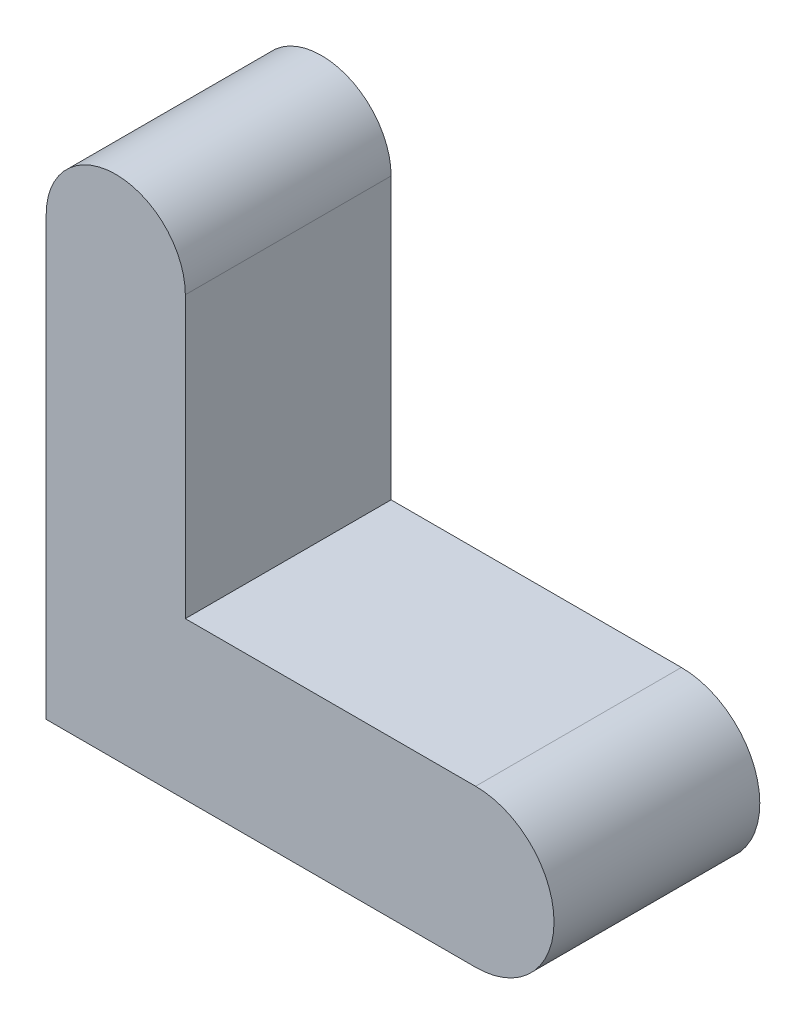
ISO-10303-21;
HEADER;
FILE_DESCRIPTION(('STEP AP214'),'2;1');
FILE_NAME('part.step','',(''),(''),'','','');
FILE_SCHEMA(('AUTOMOTIVE_DESIGN { 1 0 10303 214 1 1 1 1 }'));
ENDSEC;
DATA;
#1=APPLICATION_CONTEXT('core data for automotive mechanical design processes');
#2=APPLICATION_PROTOCOL_DEFINITION('international standard','automotive_design',2000,#1);
#3=PRODUCT_CONTEXT('',#1,'mechanical');
#4=PRODUCT('Part','Part','',(#3));
#5=PRODUCT_RELATED_PRODUCT_CATEGORY('part','',(#4));
#6=PRODUCT_DEFINITION_FORMATION('','',#4);
#7=PRODUCT_DEFINITION_CONTEXT('part definition',#1,'design');
#8=PRODUCT_DEFINITION('design','',#6,#7);
#9=PRODUCT_DEFINITION_SHAPE('','',#8);
#10=(LENGTH_UNIT() NAMED_UNIT(*) SI_UNIT(.MILLI.,.METRE.));
#11=(NAMED_UNIT(*) PLANE_ANGLE_UNIT() SI_UNIT($,.RADIAN.));
#12=(NAMED_UNIT(*) SI_UNIT($,.STERADIAN.) SOLID_ANGLE_UNIT());
#13=UNCERTAINTY_MEASURE_WITH_UNIT(LENGTH_MEASURE(1.E-05),#10,'distance_accuracy_value','');
#14=(GEOMETRIC_REPRESENTATION_CONTEXT(3) GLOBAL_UNCERTAINTY_ASSIGNED_CONTEXT((#13)) GLOBAL_UNIT_ASSIGNED_CONTEXT((#10,
#11,#12)) REPRESENTATION_CONTEXT('',''));
#15=CARTESIAN_POINT('',(0.,0.,0.));
#16=DIRECTION('',(0.,0.,1.));
#17=DIRECTION('',(1.,0.,0.));
#18=AXIS2_PLACEMENT_3D('',#15,#16,#17);
#19=CARTESIAN_POINT('',(45.1262891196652,0.,81.));
#20=DIRECTION('',(0.,0.,-1.));
#21=DIRECTION('',(-1.,0.,0.));
#22=AXIS2_PLACEMENT_3D('',#19,#20,#21);
#23=CYLINDRICAL_SURFACE('',#22,19.4348844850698);
#24=CARTESIAN_POINT('',(45.1262891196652,0.,30.));
#25=DIRECTION('',(0.,0.,1.));
#26=DIRECTION('',(1.,0.,0.));
#27=AXIS2_PLACEMENT_3D('',#24,#25,#26);
#28=CIRCLE('',#27,19.4348844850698);
#29=CARTESIAN_POINT('',(45.1262891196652,-19.4348844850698,30.));
#30=VERTEX_POINT('',#29);
#31=CARTESIAN_POINT('',(45.1262891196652,19.4348844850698,30.));
#32=VERTEX_POINT('',#31);
#33=EDGE_CURVE('E88',#30,#32,#28,.T.);
#34=ORIENTED_EDGE('',*,*,#33,.T.);
#35=DIRECTION('',(0.,0.,-1.));
#36=VECTOR('',#35,1.);
#37=CARTESIAN_POINT('',(45.1262891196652,19.4348844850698,81.));
#38=LINE('',#37,#36);
#39=CARTESIAN_POINT('',(45.1262891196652,19.4348844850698,81.));
#40=VERTEX_POINT('',#39);
#41=EDGE_CURVE('E11',#40,#32,#38,.T.);
#42=ORIENTED_EDGE('',*,*,#41,.F.);
#43=CARTESIAN_POINT('',(45.1262891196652,0.,81.));
#44=DIRECTION('',(0.,0.,1.));
#45=DIRECTION('',(1.,0.,0.));
#46=AXIS2_PLACEMENT_3D('',#43,#44,#45);
#47=CIRCLE('',#46,19.4348844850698);
#48=CARTESIAN_POINT('',(45.1262891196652,-19.4348844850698,81.));
#49=VERTEX_POINT('',#48);
#50=EDGE_CURVE('E111',#49,#40,#47,.T.);
#51=ORIENTED_EDGE('',*,*,#50,.F.);
#52=DIRECTION('',(0.,0.,-1.));
#53=VECTOR('',#52,1.);
#54=CARTESIAN_POINT('',(45.1262891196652,-19.4348844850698,81.));
#55=LINE('',#54,#53);
#56=EDGE_CURVE('E101',#49,#30,#55,.T.);
#57=ORIENTED_EDGE('',*,*,#56,.T.);
#58=EDGE_LOOP('',(#34,#42,#51,#57));
#59=FACE_BOUND('',#58,.T.);
#60=ADVANCED_FACE('F32',(#59),#23,.T.);
#61=CARTESIAN_POINT('',(45.1262891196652,19.4348844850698,81.));
#62=DIRECTION('',(0.,-1.,0.));
#63=DIRECTION('',(1.,0.,0.));
#64=AXIS2_PLACEMENT_3D('',#61,#62,#63);
#65=PLANE('',#64);
#66=DIRECTION('',(-1.,0.,0.));
#67=VECTOR('',#66,1.);
#68=CARTESIAN_POINT('',(45.1262891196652,19.4348844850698,30.));
#69=LINE('',#68,#67);
#70=CARTESIAN_POINT('',(-26.8203416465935,19.4348844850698,30.));
#71=VERTEX_POINT('',#70);
#72=EDGE_CURVE('E84',#32,#71,#69,.T.);
#73=ORIENTED_EDGE('',*,*,#72,.T.);
#74=DIRECTION('',(0.,0.,-1.));
#75=VECTOR('',#74,1.);
#76=CARTESIAN_POINT('',(-26.8203416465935,19.4348844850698,81.));
#77=LINE('',#76,#75);
#78=CARTESIAN_POINT('',(-26.8203416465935,19.4348844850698,81.));
#79=VERTEX_POINT('',#78);
#80=EDGE_CURVE('E39',#79,#71,#77,.T.);
#81=ORIENTED_EDGE('',*,*,#80,.F.);
#82=DIRECTION('',(-1.,0.,0.));
#83=VECTOR('',#82,1.);
#84=CARTESIAN_POINT('',(45.1262891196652,19.4348844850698,81.));
#85=LINE('',#84,#83);
#86=EDGE_CURVE('E97',#40,#79,#85,.T.);
#87=ORIENTED_EDGE('',*,*,#86,.F.);
#88=ORIENTED_EDGE('',*,*,#41,.T.);
#89=EDGE_LOOP('',(#73,#81,#87,#88));
#90=FACE_BOUND('',#89,.T.);
#91=ADVANCED_FACE('F96',(#90),#65,.F.);
#92=CARTESIAN_POINT('',(-26.8203416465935,19.4348844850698,81.));
#93=DIRECTION('',(-1.,0.,0.));
#94=DIRECTION('',(0.,0.,1.));
#95=AXIS2_PLACEMENT_3D('',#92,#93,#94);
#96=PLANE('',#95);
#97=DIRECTION('',(0.,1.,0.));
#98=VECTOR('',#97,1.);
#99=CARTESIAN_POINT('',(-26.8203416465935,19.4348844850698,30.));
#100=LINE('',#99,#98);
#101=CARTESIAN_POINT('',(-26.8203416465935,88.9543759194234,30.));
#102=VERTEX_POINT('',#101);
#103=EDGE_CURVE('E90',#71,#102,#100,.T.);
#104=ORIENTED_EDGE('',*,*,#103,.T.);
#105=DIRECTION('',(0.,0.,-1.));
#106=VECTOR('',#105,1.);
#107=CARTESIAN_POINT('',(-26.8203416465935,88.9543759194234,81.));
#108=LINE('',#107,#106);
#109=CARTESIAN_POINT('',(-26.8203416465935,88.9543759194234,81.));
#110=VERTEX_POINT('',#109);
#111=EDGE_CURVE('E127',#110,#102,#108,.T.);
#112=ORIENTED_EDGE('',*,*,#111,.F.);
#113=DIRECTION('',(0.,1.,0.));
#114=VECTOR('',#113,1.);
#115=CARTESIAN_POINT('',(-26.8203416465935,19.4348844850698,81.));
#116=LINE('',#115,#114);
#117=EDGE_CURVE('E114',#79,#110,#116,.T.);
#118=ORIENTED_EDGE('',*,*,#117,.F.);
#119=ORIENTED_EDGE('',*,*,#80,.T.);
#120=EDGE_LOOP('',(#104,#112,#118,#119));
#121=FACE_BOUND('',#120,.T.);
#122=ADVANCED_FACE('F131',(#121),#96,.F.);
#123=CARTESIAN_POINT('',(-44.061989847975,88.9543759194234,81.));
#124=DIRECTION('',(0.,0.,-1.));
#125=DIRECTION('',(-1.,0.,0.));
#126=AXIS2_PLACEMENT_3D('',#123,#124,#125);
#127=CYLINDRICAL_SURFACE('',#126,17.2416482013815);
#128=CARTESIAN_POINT('',(-44.061989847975,88.9543759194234,30.));
#129=DIRECTION('',(0.,0.,1.));
#130=DIRECTION('',(1.,0.,0.));
#131=AXIS2_PLACEMENT_3D('',#128,#129,#130);
#132=CIRCLE('',#131,17.2416482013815);
#133=CARTESIAN_POINT('',(-61.3036380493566,88.9543759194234,30.));
#134=VERTEX_POINT('',#133);
#135=EDGE_CURVE('E105',#102,#134,#132,.T.);
#136=ORIENTED_EDGE('',*,*,#135,.T.);
#137=DIRECTION('',(0.,0.,-1.));
#138=VECTOR('',#137,1.);
#139=CARTESIAN_POINT('',(-61.3036380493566,88.9543759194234,81.));
#140=LINE('',#139,#138);
#141=CARTESIAN_POINT('',(-61.3036380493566,88.9543759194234,81.));
#142=VERTEX_POINT('',#141);
#143=EDGE_CURVE('E124',#142,#134,#140,.T.);
#144=ORIENTED_EDGE('',*,*,#143,.F.);
#145=CARTESIAN_POINT('',(-44.061989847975,88.9543759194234,81.));
#146=DIRECTION('',(0.,0.,1.));
#147=DIRECTION('',(1.,0.,0.));
#148=AXIS2_PLACEMENT_3D('',#145,#146,#147);
#149=CIRCLE('',#148,17.2416482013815);
#150=EDGE_CURVE('E116',#110,#142,#149,.T.);
#151=ORIENTED_EDGE('',*,*,#150,.F.);
#152=ORIENTED_EDGE('',*,*,#111,.T.);
#153=EDGE_LOOP('',(#136,#144,#151,#152));
#154=FACE_BOUND('',#153,.T.);
#155=ADVANCED_FACE('F137',(#154),#127,.T.);
#156=CARTESIAN_POINT('',(-61.3036380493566,88.9543759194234,81.));
#157=DIRECTION('',(1.,0.,0.));
#158=DIRECTION('',(0.,1.,0.));
#159=AXIS2_PLACEMENT_3D('',#156,#157,#158);
#160=PLANE('',#159);
#161=DIRECTION('',(0.,-1.,0.));
#162=VECTOR('',#161,1.);
#163=CARTESIAN_POINT('',(-61.3036380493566,88.9543759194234,30.));
#164=LINE('',#163,#162);
#165=CARTESIAN_POINT('',(-61.3036380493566,-19.4348844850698,30.));
#166=VERTEX_POINT('',#165);
#167=EDGE_CURVE('E107',#134,#166,#164,.T.);
#168=ORIENTED_EDGE('',*,*,#167,.T.);
#169=DIRECTION('',(0.,0.,-1.));
#170=VECTOR('',#169,1.);
#171=CARTESIAN_POINT('',(-61.3036380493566,-19.4348844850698,81.));
#172=LINE('',#171,#170);
#173=CARTESIAN_POINT('',(-61.3036380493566,-19.4348844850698,81.));
#174=VERTEX_POINT('',#173);
#175=EDGE_CURVE('E121',#174,#166,#172,.T.);
#176=ORIENTED_EDGE('',*,*,#175,.F.);
#177=DIRECTION('',(0.,-1.,0.));
#178=VECTOR('',#177,1.);
#179=CARTESIAN_POINT('',(-61.3036380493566,88.9543759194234,81.));
#180=LINE('',#179,#178);
#181=EDGE_CURVE('E51',#142,#174,#180,.T.);
#182=ORIENTED_EDGE('',*,*,#181,.F.);
#183=ORIENTED_EDGE('',*,*,#143,.T.);
#184=EDGE_LOOP('',(#168,#176,#182,#183));
#185=FACE_BOUND('',#184,.T.);
#186=ADVANCED_FACE('F140',(#185),#160,.F.);
#187=CARTESIAN_POINT('',(-61.3036380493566,-19.4348844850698,81.));
#188=DIRECTION('',(0.,1.,0.));
#189=DIRECTION('',(-1.,0.,0.));
#190=AXIS2_PLACEMENT_3D('',#187,#188,#189);
#191=PLANE('',#190);
#192=DIRECTION('',(1.,0.,0.));
#193=VECTOR('',#192,1.);
#194=CARTESIAN_POINT('',(-61.3036380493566,-19.4348844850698,30.));
#195=LINE('',#194,#193);
#196=EDGE_CURVE('E109',#166,#30,#195,.T.);
#197=ORIENTED_EDGE('',*,*,#196,.T.);
#198=ORIENTED_EDGE('',*,*,#56,.F.);
#199=DIRECTION('',(1.,0.,0.));
#200=VECTOR('',#199,1.);
#201=CARTESIAN_POINT('',(-61.3036380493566,-19.4348844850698,81.));
#202=LINE('',#201,#200);
#203=EDGE_CURVE('E46',#174,#49,#202,.T.);
#204=ORIENTED_EDGE('',*,*,#203,.F.);
#205=ORIENTED_EDGE('',*,*,#175,.T.);
#206=EDGE_LOOP('',(#197,#198,#204,#205));
#207=FACE_BOUND('',#206,.T.);
#208=ADVANCED_FACE('F142',(#207),#191,.F.);
#209=CARTESIAN_POINT('',(45.1262891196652,0.,81.));
#210=DIRECTION('',(0.,0.,1.));
#211=DIRECTION('',(1.,0.,0.));
#212=AXIS2_PLACEMENT_3D('',#209,#210,#211);
#213=PLANE('',#212);
#214=ORIENTED_EDGE('',*,*,#50,.T.);
#215=ORIENTED_EDGE('',*,*,#86,.T.);
#216=ORIENTED_EDGE('',*,*,#117,.T.);
#217=ORIENTED_EDGE('',*,*,#150,.T.);
#218=ORIENTED_EDGE('',*,*,#181,.T.);
#219=ORIENTED_EDGE('',*,*,#203,.T.);
#220=EDGE_LOOP('',(#214,#215,#216,#217,#218,#219));
#221=FACE_BOUND('',#220,.T.);
#222=ADVANCED_FACE('F134',(#221),#213,.T.);
#223=CARTESIAN_POINT('',(45.1262891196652,0.,30.));
#224=DIRECTION('',(0.,0.,1.));
#225=DIRECTION('',(1.,0.,0.));
#226=AXIS2_PLACEMENT_3D('',#223,#224,#225);
#227=PLANE('',#226);
#228=ORIENTED_EDGE('',*,*,#33,.F.);
#229=ORIENTED_EDGE('',*,*,#196,.F.);
#230=ORIENTED_EDGE('',*,*,#167,.F.);
#231=ORIENTED_EDGE('',*,*,#135,.F.);
#232=ORIENTED_EDGE('',*,*,#103,.F.);
#233=ORIENTED_EDGE('',*,*,#72,.F.);
#234=EDGE_LOOP('',(#228,#229,#230,#231,#232,#233));
#235=FACE_BOUND('',#234,.T.);
#236=ADVANCED_FACE('F85',(#235),#227,.F.);
#237=CLOSED_SHELL('',(#60,#91,#122,#155,#186,#208,#222,#236));
#238=MANIFOLD_SOLID_BREP('B2',#237);
#239=ADVANCED_BREP_SHAPE_REPRESENTATION('',(#18,#238),#14);
#240=SHAPE_DEFINITION_REPRESENTATION(#9,#239);
ENDSEC;
END-ISO-10303-21;
